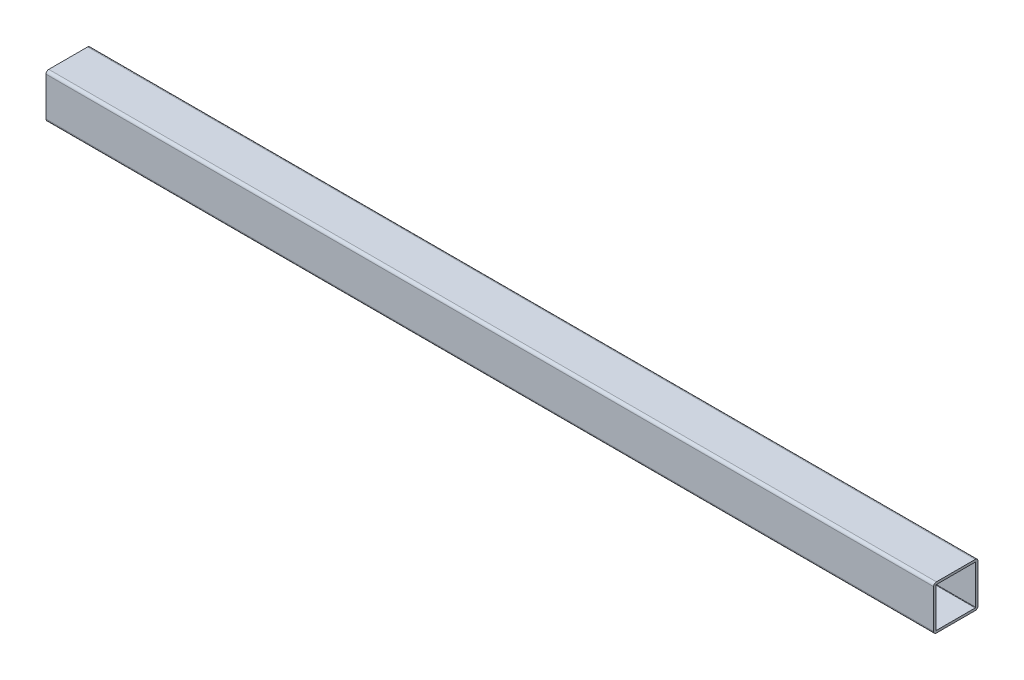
from build123d import *

# Parameters (mm, degrees)
EXTRUDE1_DEPTH = 508


with BuildPart() as part:
    # Sketch1 → Extrude1 (new body)
    with BuildSketch(Plane(origin=(0, 0, 0), x_dir=(0, 0, -1), z_dir=(1, 0, 0))):
        with BuildLine():
            Line((-5.373037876, 5.244240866), (16.851962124, 5.244240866))
            ThreePointArc((16.851962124, 5.244240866), (17.974494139, 4.779272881), (18.439462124, 3.656740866))
            Line((18.439462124, 3.656740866), (18.439462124, -18.568259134))
            ThreePointArc((18.439462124, -18.568259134), (17.974494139, -19.690791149), (16.851962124, -20.155759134))
            Line((16.851962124, -20.155759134), (-5.373037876, -20.155759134))
            ThreePointArc((-5.373037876, -20.155759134), (-6.495569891, -19.690791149), (-6.960537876, -18.568259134))
            Line((-6.960537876, -18.568259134), (-6.960537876, 3.656740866))
            ThreePointArc((-6.960537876, 3.656740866), (-6.495569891, 4.779272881), (-5.373037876, 5.244240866))
        make_face()
        with BuildLine():
            Line((-5.373037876, 3.898040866), (16.851962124, 3.898040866))
            ThreePointArc((16.851962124, 3.898040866), (17.02258699, 3.827365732), (17.093262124, 3.656740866))
            Line((17.093262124, 3.656740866), (17.093262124, -18.568259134))
            ThreePointArc((17.093262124, -18.568259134), (17.02258699, -18.738884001), (16.851962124, -18.809559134))
            Line((16.851962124, -18.809559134), (-5.373037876, -18.809559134))
            ThreePointArc((-5.373037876, -18.809559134), (-5.543662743, -18.738884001), (-5.614337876, -18.568259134))
            Line((-5.614337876, -18.568259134), (-5.614337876, 3.656740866))
            ThreePointArc((-5.614337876, 3.656740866), (-5.543662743, 3.827365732), (-5.373037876, 3.898040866))
        make_face(mode=Mode.SUBTRACT)
    extrude(amount=EXTRUDE1_DEPTH)


solid = part.part
